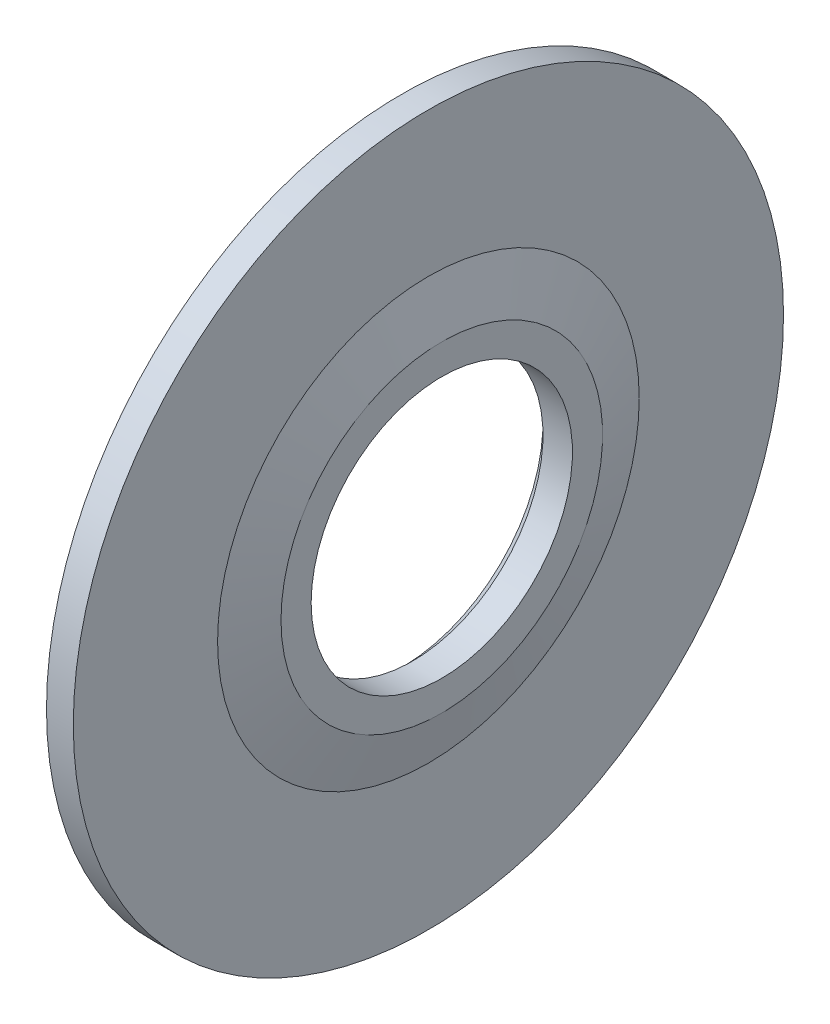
from build123d import *


with BuildPart() as part:
    # Esquisse1 → R_volution1 (revolve)
    with BuildSketch(Plane.XY, mode=Mode.PRIVATE) as r_volution1_sk:
        Polygon((0, 105.5), (0, 265), (20, 265), (20, 157.320508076), (30, 120), (30, 97.5), (8, 97.5), align=None)
    revolve(r_volution1_sk.sketch.rotate(Axis((0, 0, 0), (1, 0, 0)), 90), axis=Axis((0, 0, 0), (1, 0, 0)))


solid = part.part
